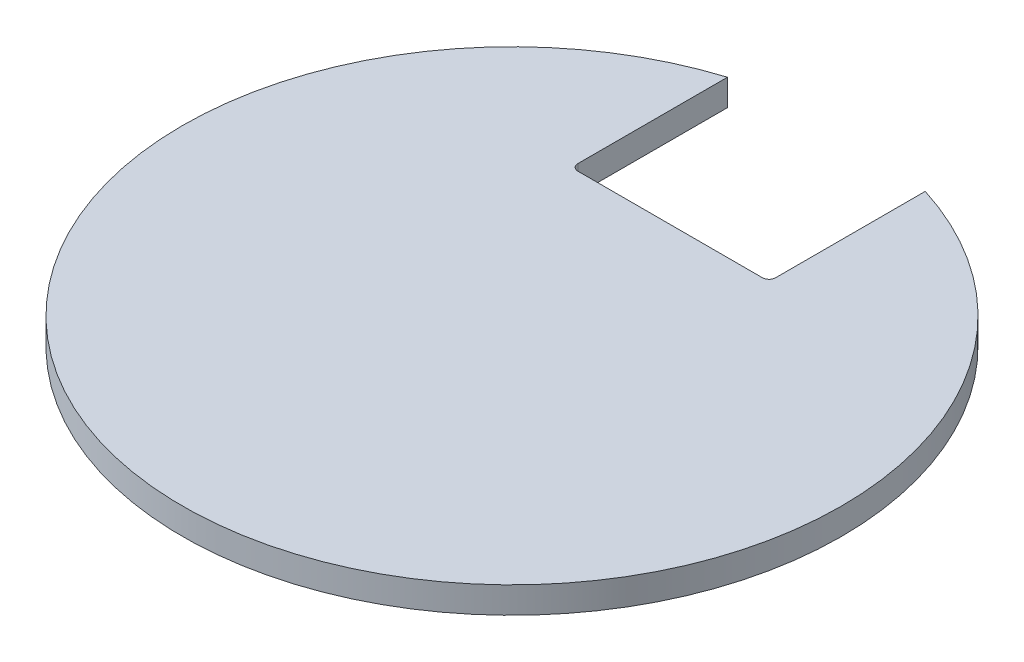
ISO-10303-21;
HEADER;
FILE_DESCRIPTION(('STEP AP214'),'2;1');
FILE_NAME('part.step','',(''),(''),'','','');
FILE_SCHEMA(('AUTOMOTIVE_DESIGN { 1 0 10303 214 1 1 1 1 }'));
ENDSEC;
DATA;
#1=APPLICATION_CONTEXT('core data for automotive mechanical design processes');
#2=APPLICATION_PROTOCOL_DEFINITION('international standard','automotive_design',2000,#1);
#3=PRODUCT_CONTEXT('',#1,'mechanical');
#4=PRODUCT('Part','Part','',(#3));
#5=PRODUCT_RELATED_PRODUCT_CATEGORY('part','',(#4));
#6=PRODUCT_DEFINITION_FORMATION('','',#4);
#7=PRODUCT_DEFINITION_CONTEXT('part definition',#1,'design');
#8=PRODUCT_DEFINITION('design','',#6,#7);
#9=PRODUCT_DEFINITION_SHAPE('','',#8);
#10=(LENGTH_UNIT() NAMED_UNIT(*) SI_UNIT(.MILLI.,.METRE.));
#11=(NAMED_UNIT(*) PLANE_ANGLE_UNIT() SI_UNIT($,.RADIAN.));
#12=(NAMED_UNIT(*) SI_UNIT($,.STERADIAN.) SOLID_ANGLE_UNIT());
#13=UNCERTAINTY_MEASURE_WITH_UNIT(LENGTH_MEASURE(1.E-05),#10,'distance_accuracy_value','');
#14=(GEOMETRIC_REPRESENTATION_CONTEXT(3) GLOBAL_UNCERTAINTY_ASSIGNED_CONTEXT((#13)) GLOBAL_UNIT_ASSIGNED_CONTEXT((#10,
#11,#12)) REPRESENTATION_CONTEXT('',''));
#15=CARTESIAN_POINT('',(0.,0.,0.));
#16=DIRECTION('',(0.,0.,1.));
#17=DIRECTION('',(1.,0.,0.));
#18=AXIS2_PLACEMENT_3D('',#15,#16,#17);
#19=CARTESIAN_POINT('',(0.,2.,0.));
#20=DIRECTION('',(0.,-1.,0.));
#21=DIRECTION('',(0.,0.,-1.));
#22=AXIS2_PLACEMENT_3D('',#19,#20,#21);
#23=CYLINDRICAL_SURFACE('',#22,25.);
#24=DIRECTION('',(0.,-1.,0.));
#25=VECTOR('',#24,1.);
#26=CARTESIAN_POINT('',(7.5,2.,-23.8484800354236));
#27=LINE('',#26,#25);
#28=CARTESIAN_POINT('',(7.5,2.,-23.8484800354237));
#29=VERTEX_POINT('',#28);
#30=CARTESIAN_POINT('',(7.5,0.,-23.8484800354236));
#31=VERTEX_POINT('',#30);
#32=EDGE_CURVE('E102',#29,#31,#27,.T.);
#33=ORIENTED_EDGE('',*,*,#32,.F.);
#34=CARTESIAN_POINT('',(0.,2.,0.));
#35=DIRECTION('',(0.,-1.,0.));
#36=DIRECTION('',(0.,0.,-1.));
#37=AXIS2_PLACEMENT_3D('',#34,#35,#36);
#38=CIRCLE('',#37,25.);
#39=CARTESIAN_POINT('',(-7.5,2.,-23.8484800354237));
#40=VERTEX_POINT('',#39);
#41=EDGE_CURVE('E90',#29,#40,#38,.T.);
#42=ORIENTED_EDGE('',*,*,#41,.T.);
#43=DIRECTION('',(0.,-1.,0.));
#44=VECTOR('',#43,1.);
#45=CARTESIAN_POINT('',(-7.5,2.,-23.8484800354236));
#46=LINE('',#45,#44);
#47=CARTESIAN_POINT('',(-7.5,0.,-23.8484800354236));
#48=VERTEX_POINT('',#47);
#49=EDGE_CURVE('E92',#48,#40,#46,.F.);
#50=ORIENTED_EDGE('',*,*,#49,.F.);
#51=CARTESIAN_POINT('',(0.,0.,0.));
#52=DIRECTION('',(0.,-1.,0.));
#53=DIRECTION('',(0.,0.,-1.));
#54=AXIS2_PLACEMENT_3D('',#51,#52,#53);
#55=CIRCLE('',#54,25.);
#56=EDGE_CURVE('E106',#31,#48,#55,.T.);
#57=ORIENTED_EDGE('',*,*,#56,.F.);
#58=EDGE_LOOP('',(#33,#42,#50,#57));
#59=FACE_BOUND('',#58,.T.);
#60=ADVANCED_FACE('F35',(#59),#23,.T.);
#61=CARTESIAN_POINT('',(0.,2.,0.));
#62=DIRECTION('',(0.,-1.,0.));
#63=DIRECTION('',(0.,0.,-1.));
#64=AXIS2_PLACEMENT_3D('',#61,#62,#63);
#65=PLANE('',#64);
#66=ORIENTED_EDGE('',*,*,#41,.F.);
#67=DIRECTION('',(0.,0.,1.));
#68=VECTOR('',#67,1.);
#69=CARTESIAN_POINT('',(7.5,2.,-42.));
#70=LINE('',#69,#68);
#71=CARTESIAN_POINT('',(7.5,2.,-12.5));
#72=VERTEX_POINT('',#71);
#73=EDGE_CURVE('E219',#29,#72,#70,.T.);
#74=ORIENTED_EDGE('',*,*,#73,.T.);
#75=CARTESIAN_POINT('',(7.,2.,-12.5));
#76=DIRECTION('',(0.,-1.,0.));
#77=DIRECTION('',(0.,0.,-1.));
#78=AXIS2_PLACEMENT_3D('',#75,#76,#77);
#79=CIRCLE('',#78,0.5);
#80=CARTESIAN_POINT('',(7.,2.,-12.));
#81=VERTEX_POINT('',#80);
#82=EDGE_CURVE('E128',#72,#81,#79,.T.);
#83=ORIENTED_EDGE('',*,*,#82,.T.);
#84=DIRECTION('',(-1.,0.,0.));
#85=VECTOR('',#84,1.);
#86=CARTESIAN_POINT('',(-7.5,2.,-12.));
#87=LINE('',#86,#85);
#88=CARTESIAN_POINT('',(-7.,2.,-12.));
#89=VERTEX_POINT('',#88);
#90=EDGE_CURVE('E93',#81,#89,#87,.T.);
#91=ORIENTED_EDGE('',*,*,#90,.T.);
#92=CARTESIAN_POINT('',(-7.,2.,-12.5));
#93=DIRECTION('',(0.,-1.,0.));
#94=DIRECTION('',(0.,0.,-1.));
#95=AXIS2_PLACEMENT_3D('',#92,#93,#94);
#96=CIRCLE('',#95,0.5);
#97=CARTESIAN_POINT('',(-7.5,2.,-12.5));
#98=VERTEX_POINT('',#97);
#99=EDGE_CURVE('E11',#89,#98,#96,.T.);
#100=ORIENTED_EDGE('',*,*,#99,.T.);
#101=DIRECTION('',(0.,0.,-1.));
#102=VECTOR('',#101,1.);
#103=CARTESIAN_POINT('',(-7.5,2.,-42.));
#104=LINE('',#103,#102);
#105=EDGE_CURVE('E85',#98,#40,#104,.T.);
#106=ORIENTED_EDGE('',*,*,#105,.T.);
#107=EDGE_LOOP('',(#66,#74,#83,#91,#100,#106));
#108=FACE_BOUND('',#107,.T.);
#109=ADVANCED_FACE('F87',(#108),#65,.F.);
#110=CARTESIAN_POINT('',(0.,0.,0.));
#111=DIRECTION('',(0.,-1.,0.));
#112=DIRECTION('',(0.,0.,-1.));
#113=AXIS2_PLACEMENT_3D('',#110,#111,#112);
#114=PLANE('',#113);
#115=DIRECTION('',(0.,0.,1.));
#116=VECTOR('',#115,1.);
#117=CARTESIAN_POINT('',(7.5,0.,0.));
#118=LINE('',#117,#116);
#119=CARTESIAN_POINT('',(7.5,0.,-12.5));
#120=VERTEX_POINT('',#119);
#121=EDGE_CURVE('E114',#31,#120,#118,.T.);
#122=ORIENTED_EDGE('',*,*,#121,.F.);
#123=ORIENTED_EDGE('',*,*,#56,.T.);
#124=DIRECTION('',(0.,0.,-1.));
#125=VECTOR('',#124,1.);
#126=CARTESIAN_POINT('',(-7.5,0.,0.));
#127=LINE('',#126,#125);
#128=CARTESIAN_POINT('',(-7.5,0.,-12.5));
#129=VERTEX_POINT('',#128);
#130=EDGE_CURVE('E98',#129,#48,#127,.T.);
#131=ORIENTED_EDGE('',*,*,#130,.F.);
#132=CARTESIAN_POINT('',(-7.,0.,-12.5));
#133=DIRECTION('',(0.,-1.,0.));
#134=DIRECTION('',(0.,0.,-1.));
#135=AXIS2_PLACEMENT_3D('',#132,#133,#134);
#136=CIRCLE('',#135,0.5);
#137=CARTESIAN_POINT('',(-7.,0.,-12.));
#138=VERTEX_POINT('',#137);
#139=EDGE_CURVE('E43',#129,#138,#136,.F.);
#140=ORIENTED_EDGE('',*,*,#139,.T.);
#141=DIRECTION('',(-1.,0.,0.));
#142=VECTOR('',#141,1.);
#143=CARTESIAN_POINT('',(0.,0.,-12.));
#144=LINE('',#143,#142);
#145=CARTESIAN_POINT('',(7.,0.,-12.));
#146=VERTEX_POINT('',#145);
#147=EDGE_CURVE('E105',#146,#138,#144,.T.);
#148=ORIENTED_EDGE('',*,*,#147,.F.);
#149=CARTESIAN_POINT('',(7.,0.,-12.5));
#150=DIRECTION('',(0.,-1.,0.));
#151=DIRECTION('',(0.,0.,-1.));
#152=AXIS2_PLACEMENT_3D('',#149,#150,#151);
#153=CIRCLE('',#152,0.5);
#154=EDGE_CURVE('E126',#146,#120,#153,.F.);
#155=ORIENTED_EDGE('',*,*,#154,.T.);
#156=EDGE_LOOP('',(#122,#123,#131,#140,#148,#155));
#157=FACE_BOUND('',#156,.T.);
#158=ADVANCED_FACE('F132',(#157),#114,.T.);
#159=CARTESIAN_POINT('',(7.5,2.,-42.));
#160=DIRECTION('',(1.,0.,0.));
#161=DIRECTION('',(0.,0.,-1.));
#162=AXIS2_PLACEMENT_3D('',#159,#160,#161);
#163=PLANE('',#162);
#164=ORIENTED_EDGE('',*,*,#121,.T.);
#165=DIRECTION('',(0.,-1.,0.));
#166=VECTOR('',#165,1.);
#167=CARTESIAN_POINT('',(7.5,2.,-12.5));
#168=LINE('',#167,#166);
#169=EDGE_CURVE('E122',#120,#72,#168,.F.);
#170=ORIENTED_EDGE('',*,*,#169,.T.);
#171=ORIENTED_EDGE('',*,*,#73,.F.);
#172=ORIENTED_EDGE('',*,*,#32,.T.);
#173=EDGE_LOOP('',(#164,#170,#171,#172));
#174=FACE_BOUND('',#173,.T.);
#175=ADVANCED_FACE('F151',(#174),#163,.F.);
#176=CARTESIAN_POINT('',(-7.5,2.,-42.));
#177=DIRECTION('',(-1.,0.,0.));
#178=DIRECTION('',(0.,0.,1.));
#179=AXIS2_PLACEMENT_3D('',#176,#177,#178);
#180=PLANE('',#179);
#181=ORIENTED_EDGE('',*,*,#105,.F.);
#182=DIRECTION('',(0.,-1.,0.));
#183=VECTOR('',#182,1.);
#184=CARTESIAN_POINT('',(-7.5,0.,-12.5));
#185=LINE('',#184,#183);
#186=EDGE_CURVE('E124',#98,#129,#185,.T.);
#187=ORIENTED_EDGE('',*,*,#186,.T.);
#188=ORIENTED_EDGE('',*,*,#130,.T.);
#189=ORIENTED_EDGE('',*,*,#49,.T.);
#190=EDGE_LOOP('',(#181,#187,#188,#189));
#191=FACE_BOUND('',#190,.T.);
#192=ADVANCED_FACE('F96',(#191),#180,.F.);
#193=CARTESIAN_POINT('',(-7.5,2.,-12.));
#194=DIRECTION('',(0.,0.,1.));
#195=DIRECTION('',(1.,0.,0.));
#196=AXIS2_PLACEMENT_3D('',#193,#194,#195);
#197=PLANE('',#196);
#198=ORIENTED_EDGE('',*,*,#90,.F.);
#199=DIRECTION('',(0.,-1.,0.));
#200=VECTOR('',#199,1.);
#201=CARTESIAN_POINT('',(7.,0.,-12.));
#202=LINE('',#201,#200);
#203=EDGE_CURVE('E119',#81,#146,#202,.T.);
#204=ORIENTED_EDGE('',*,*,#203,.T.);
#205=ORIENTED_EDGE('',*,*,#147,.T.);
#206=DIRECTION('',(0.,-1.,0.));
#207=VECTOR('',#206,1.);
#208=CARTESIAN_POINT('',(-7.,2.,-12.));
#209=LINE('',#208,#207);
#210=EDGE_CURVE('E117',#138,#89,#209,.F.);
#211=ORIENTED_EDGE('',*,*,#210,.T.);
#212=EDGE_LOOP('',(#198,#204,#205,#211));
#213=FACE_BOUND('',#212,.T.);
#214=ADVANCED_FACE('F135',(#213),#197,.F.);
#215=CARTESIAN_POINT('',(7.,2.,-12.5));
#216=DIRECTION('',(0.,1.,0.));
#217=DIRECTION('',(0.,0.,1.));
#218=AXIS2_PLACEMENT_3D('',#215,#216,#217);
#219=CYLINDRICAL_SURFACE('',#218,0.5);
#220=ORIENTED_EDGE('',*,*,#82,.F.);
#221=ORIENTED_EDGE('',*,*,#169,.F.);
#222=ORIENTED_EDGE('',*,*,#154,.F.);
#223=ORIENTED_EDGE('',*,*,#203,.F.);
#224=EDGE_LOOP('',(#220,#221,#222,#223));
#225=FACE_BOUND('',#224,.T.);
#226=ADVANCED_FACE('F138',(#225),#219,.F.);
#227=CARTESIAN_POINT('',(-7.,2.,-12.5));
#228=DIRECTION('',(0.,1.,0.));
#229=DIRECTION('',(0.,0.,1.));
#230=AXIS2_PLACEMENT_3D('',#227,#228,#229);
#231=CYLINDRICAL_SURFACE('',#230,0.5);
#232=ORIENTED_EDGE('',*,*,#99,.F.);
#233=ORIENTED_EDGE('',*,*,#210,.F.);
#234=ORIENTED_EDGE('',*,*,#139,.F.);
#235=ORIENTED_EDGE('',*,*,#186,.F.);
#236=EDGE_LOOP('',(#232,#233,#234,#235));
#237=FACE_BOUND('',#236,.T.);
#238=ADVANCED_FACE('F37',(#237),#231,.F.);
#239=CLOSED_SHELL('',(#60,#109,#158,#175,#192,#214,#226,#238));
#240=MANIFOLD_SOLID_BREP('B2',#239);
#241=ADVANCED_BREP_SHAPE_REPRESENTATION('',(#18,#240),#14);
#242=SHAPE_DEFINITION_REPRESENTATION(#9,#241);
ENDSEC;
END-ISO-10303-21;
